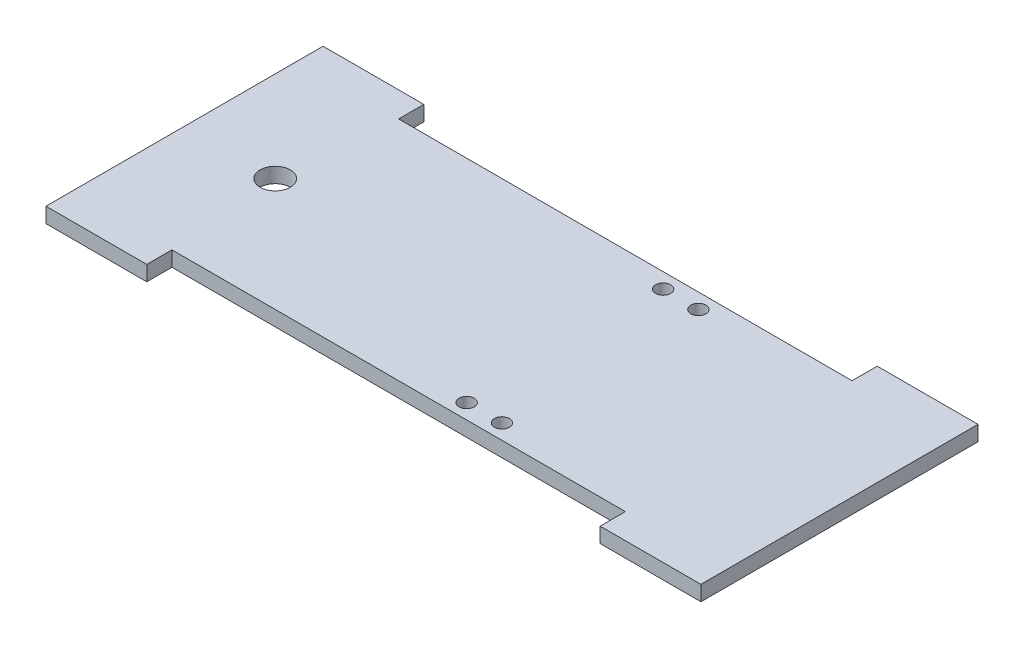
ISO-10303-21;
HEADER;
FILE_DESCRIPTION(('STEP AP214'),'2;1');
FILE_NAME('part.step','',(''),(''),'','','');
FILE_SCHEMA(('AUTOMOTIVE_DESIGN { 1 0 10303 214 1 1 1 1 }'));
ENDSEC;
DATA;
#1=APPLICATION_CONTEXT('core data for automotive mechanical design processes');
#2=APPLICATION_PROTOCOL_DEFINITION('international standard','automotive_design',2000,#1);
#3=PRODUCT_CONTEXT('',#1,'mechanical');
#4=PRODUCT('Part','Part','',(#3));
#5=PRODUCT_RELATED_PRODUCT_CATEGORY('part','',(#4));
#6=PRODUCT_DEFINITION_FORMATION('','',#4);
#7=PRODUCT_DEFINITION_CONTEXT('part definition',#1,'design');
#8=PRODUCT_DEFINITION('design','',#6,#7);
#9=PRODUCT_DEFINITION_SHAPE('','',#8);
#10=(LENGTH_UNIT() NAMED_UNIT(*) SI_UNIT(.MILLI.,.METRE.));
#11=(NAMED_UNIT(*) PLANE_ANGLE_UNIT() SI_UNIT($,.RADIAN.));
#12=(NAMED_UNIT(*) SI_UNIT($,.STERADIAN.) SOLID_ANGLE_UNIT());
#13=UNCERTAINTY_MEASURE_WITH_UNIT(LENGTH_MEASURE(1.E-05),#10,'distance_accuracy_value','');
#14=(GEOMETRIC_REPRESENTATION_CONTEXT(3) GLOBAL_UNCERTAINTY_ASSIGNED_CONTEXT((#13)) GLOBAL_UNIT_ASSIGNED_CONTEXT((#10,
#11,#12)) REPRESENTATION_CONTEXT('',''));
#15=CARTESIAN_POINT('',(0.,0.,0.));
#16=DIRECTION('',(0.,0.,1.));
#17=DIRECTION('',(1.,0.,0.));
#18=AXIS2_PLACEMENT_3D('',#15,#16,#17);
#19=CARTESIAN_POINT('',(-86.093926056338,0.420950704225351,55.));
#20=DIRECTION('',(0.,0.,1.));
#21=DIRECTION('',(1.,0.,0.));
#22=AXIS2_PLACEMENT_3D('',#19,#20,#21);
#23=PLANE('',#22);
#24=DIRECTION('',(0.,-1.,0.));
#25=VECTOR('',#24,1.);
#26=CARTESIAN_POINT('',(-66.093926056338,0.420950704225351,55.));
#27=LINE('',#26,#25);
#28=CARTESIAN_POINT('',(-66.093926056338,3.42095070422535,55.));
#29=VERTEX_POINT('',#28);
#30=CARTESIAN_POINT('',(-66.093926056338,0.420950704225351,55.));
#31=VERTEX_POINT('',#30);
#32=EDGE_CURVE('E11',#29,#31,#27,.T.);
#33=ORIENTED_EDGE('',*,*,#32,.F.);
#34=DIRECTION('',(-1.,0.,0.));
#35=VECTOR('',#34,1.);
#36=CARTESIAN_POINT('',(-86.093926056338,3.42095070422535,55.));
#37=LINE('',#36,#35);
#38=CARTESIAN_POINT('',(-86.093926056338,3.42095070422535,55.));
#39=VERTEX_POINT('',#38);
#40=EDGE_CURVE('E191',#29,#39,#37,.T.);
#41=ORIENTED_EDGE('',*,*,#40,.T.);
#42=DIRECTION('',(0.,-1.,0.));
#43=VECTOR('',#42,1.);
#44=CARTESIAN_POINT('',(-86.093926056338,3.42095070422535,55.));
#45=LINE('',#44,#43);
#46=CARTESIAN_POINT('',(-86.093926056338,0.420950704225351,55.));
#47=VERTEX_POINT('',#46);
#48=EDGE_CURVE('E182',#39,#47,#45,.T.);
#49=ORIENTED_EDGE('',*,*,#48,.T.);
#50=DIRECTION('',(1.,0.,0.));
#51=VECTOR('',#50,1.);
#52=CARTESIAN_POINT('',(-86.093926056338,0.420950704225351,55.));
#53=LINE('',#52,#51);
#54=EDGE_CURVE('E186',#47,#31,#53,.T.);
#55=ORIENTED_EDGE('',*,*,#54,.T.);
#56=EDGE_LOOP('',(#33,#41,#49,#55));
#57=FACE_BOUND('',#56,.T.);
#58=ADVANCED_FACE('F31',(#57),#23,.T.);
#59=CARTESIAN_POINT('',(-86.093926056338,0.420950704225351,0.));
#60=DIRECTION('',(0.,0.,1.));
#61=DIRECTION('',(1.,0.,0.));
#62=AXIS2_PLACEMENT_3D('',#59,#60,#61);
#63=PLANE('',#62);
#64=DIRECTION('',(-1.,0.,0.));
#65=VECTOR('',#64,1.);
#66=CARTESIAN_POINT('',(-86.093926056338,3.42095070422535,0.));
#67=LINE('',#66,#65);
#68=CARTESIAN_POINT('',(-66.093926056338,3.42095070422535,0.));
#69=VERTEX_POINT('',#68);
#70=CARTESIAN_POINT('',(-86.093926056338,3.42095070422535,0.));
#71=VERTEX_POINT('',#70);
#72=EDGE_CURVE('E178',#69,#71,#67,.T.);
#73=ORIENTED_EDGE('',*,*,#72,.F.);
#74=DIRECTION('',(0.,-1.,0.));
#75=VECTOR('',#74,1.);
#76=CARTESIAN_POINT('',(-66.093926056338,0.420950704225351,0.));
#77=LINE('',#76,#75);
#78=CARTESIAN_POINT('',(-66.093926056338,0.420950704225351,0.));
#79=VERTEX_POINT('',#78);
#80=EDGE_CURVE('E208',#69,#79,#77,.T.);
#81=ORIENTED_EDGE('',*,*,#80,.T.);
#82=DIRECTION('',(1.,0.,0.));
#83=VECTOR('',#82,1.);
#84=CARTESIAN_POINT('',(-86.093926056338,0.420950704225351,0.));
#85=LINE('',#84,#83);
#86=CARTESIAN_POINT('',(-86.093926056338,0.420950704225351,0.));
#87=VERTEX_POINT('',#86);
#88=EDGE_CURVE('E173',#87,#79,#85,.T.);
#89=ORIENTED_EDGE('',*,*,#88,.F.);
#90=DIRECTION('',(0.,-1.,0.));
#91=VECTOR('',#90,1.);
#92=CARTESIAN_POINT('',(-86.093926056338,3.42095070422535,0.));
#93=LINE('',#92,#91);
#94=EDGE_CURVE('E169',#71,#87,#93,.T.);
#95=ORIENTED_EDGE('',*,*,#94,.F.);
#96=EDGE_LOOP('',(#73,#81,#89,#95));
#97=FACE_BOUND('',#96,.T.);
#98=ADVANCED_FACE('F212',(#97),#63,.F.);
#99=CARTESIAN_POINT('',(-86.093926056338,3.42095070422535,55.));
#100=DIRECTION('',(1.,0.,0.));
#101=DIRECTION('',(0.,0.,-1.));
#102=AXIS2_PLACEMENT_3D('',#99,#100,#101);
#103=PLANE('',#102);
#104=ORIENTED_EDGE('',*,*,#94,.T.);
#105=DIRECTION('',(0.,0.,-1.));
#106=VECTOR('',#105,1.);
#107=CARTESIAN_POINT('',(-86.093926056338,0.420950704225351,55.));
#108=LINE('',#107,#106);
#109=EDGE_CURVE('E203',#47,#87,#108,.T.);
#110=ORIENTED_EDGE('',*,*,#109,.F.);
#111=ORIENTED_EDGE('',*,*,#48,.F.);
#112=DIRECTION('',(0.,0.,-1.));
#113=VECTOR('',#112,1.);
#114=CARTESIAN_POINT('',(-86.093926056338,3.42095070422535,55.));
#115=LINE('',#114,#113);
#116=EDGE_CURVE('E194',#39,#71,#115,.T.);
#117=ORIENTED_EDGE('',*,*,#116,.T.);
#118=EDGE_LOOP('',(#104,#110,#111,#117));
#119=FACE_BOUND('',#118,.T.);
#120=ADVANCED_FACE('F33',(#119),#103,.F.);
#121=CARTESIAN_POINT('',(-86.093926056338,0.420950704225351,55.));
#122=DIRECTION('',(0.,1.,0.));
#123=DIRECTION('',(0.,0.,1.));
#124=AXIS2_PLACEMENT_3D('',#121,#122,#123);
#125=PLANE('',#124);
#126=CARTESIAN_POINT('',(-10.593926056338,0.420950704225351,8.));
#127=DIRECTION('',(0.,1.,0.));
#128=DIRECTION('',(0.,0.,1.));
#129=AXIS2_PLACEMENT_3D('',#126,#127,#128);
#130=CIRCLE('',#129,1.5);
#131=CARTESIAN_POINT('',(-10.593926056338,0.420950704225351,9.5));
#132=VERTEX_POINT('',#131);
#133=EDGE_CURVE('E273',#132,#132,#130,.T.);
#134=ORIENTED_EDGE('',*,*,#133,.T.);
#135=EDGE_LOOP('',(#134));
#136=FACE_BOUND('',#135,.T.);
#137=CARTESIAN_POINT('',(-10.593926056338,0.420950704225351,47.));
#138=DIRECTION('',(0.,1.,0.));
#139=DIRECTION('',(0.,0.,1.));
#140=AXIS2_PLACEMENT_3D('',#137,#138,#139);
#141=CIRCLE('',#140,1.5);
#142=CARTESIAN_POINT('',(-10.593926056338,0.420950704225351,48.5));
#143=VERTEX_POINT('',#142);
#144=EDGE_CURVE('E267',#143,#143,#141,.T.);
#145=ORIENTED_EDGE('',*,*,#144,.T.);
#146=EDGE_LOOP('',(#145));
#147=FACE_BOUND('',#146,.T.);
#148=CARTESIAN_POINT('',(-3.59392605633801,0.420950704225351,47.));
#149=DIRECTION('',(0.,1.,0.));
#150=DIRECTION('',(0.,0.,1.));
#151=AXIS2_PLACEMENT_3D('',#148,#149,#150);
#152=CIRCLE('',#151,1.5);
#153=CARTESIAN_POINT('',(-3.59392605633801,0.420950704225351,48.5));
#154=VERTEX_POINT('',#153);
#155=EDGE_CURVE('E258',#154,#154,#152,.T.);
#156=ORIENTED_EDGE('',*,*,#155,.T.);
#157=EDGE_LOOP('',(#156));
#158=FACE_BOUND('',#157,.T.);
#159=CARTESIAN_POINT('',(-3.59392605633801,0.420950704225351,8.));
#160=DIRECTION('',(0.,1.,0.));
#161=DIRECTION('',(0.,0.,1.));
#162=AXIS2_PLACEMENT_3D('',#159,#160,#161);
#163=CIRCLE('',#162,1.5);
#164=CARTESIAN_POINT('',(-3.59392605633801,0.420950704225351,9.5));
#165=VERTEX_POINT('',#164);
#166=EDGE_CURVE('E252',#165,#165,#163,.T.);
#167=ORIENTED_EDGE('',*,*,#166,.T.);
#168=EDGE_LOOP('',(#167));
#169=FACE_BOUND('',#168,.T.);
#170=CARTESIAN_POINT('',(-68.093926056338,0.420950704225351,27.5));
#171=DIRECTION('',(0.,1.,0.));
#172=DIRECTION('',(0.,0.,1.));
#173=AXIS2_PLACEMENT_3D('',#170,#171,#172);
#174=CIRCLE('',#173,3.00000000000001);
#175=CARTESIAN_POINT('',(-68.093926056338,0.420950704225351,30.5));
#176=VERTEX_POINT('',#175);
#177=EDGE_CURVE('E245',#176,#176,#174,.T.);
#178=ORIENTED_EDGE('',*,*,#177,.T.);
#179=EDGE_LOOP('',(#178));
#180=FACE_BOUND('',#179,.T.);
#181=DIRECTION('',(-1.,0.,0.));
#182=VECTOR('',#181,1.);
#183=CARTESIAN_POINT('',(-86.093926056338,0.420950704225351,50.));
#184=LINE('',#183,#182);
#185=CARTESIAN_POINT('',(23.906073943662,0.420950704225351,50.));
#186=VERTEX_POINT('',#185);
#187=CARTESIAN_POINT('',(-66.093926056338,0.420950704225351,50.));
#188=VERTEX_POINT('',#187);
#189=EDGE_CURVE('E127',#186,#188,#184,.T.);
#190=ORIENTED_EDGE('',*,*,#189,.T.);
#191=DIRECTION('',(0.,0.,1.));
#192=VECTOR('',#191,1.);
#193=CARTESIAN_POINT('',(-66.093926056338,0.420950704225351,55.));
#194=LINE('',#193,#192);
#195=EDGE_CURVE('E145',#188,#31,#194,.T.);
#196=ORIENTED_EDGE('',*,*,#195,.T.);
#197=ORIENTED_EDGE('',*,*,#54,.F.);
#198=ORIENTED_EDGE('',*,*,#109,.T.);
#199=ORIENTED_EDGE('',*,*,#88,.T.);
#200=DIRECTION('',(0.,0.,1.));
#201=VECTOR('',#200,1.);
#202=CARTESIAN_POINT('',(-66.093926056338,0.420950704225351,55.));
#203=LINE('',#202,#201);
#204=CARTESIAN_POINT('',(-66.093926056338,0.420950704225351,5.));
#205=VERTEX_POINT('',#204);
#206=EDGE_CURVE('E163',#79,#205,#203,.T.);
#207=ORIENTED_EDGE('',*,*,#206,.T.);
#208=DIRECTION('',(1.,0.,0.));
#209=VECTOR('',#208,1.);
#210=CARTESIAN_POINT('',(-86.093926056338,0.420950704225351,5.));
#211=LINE('',#210,#209);
#212=CARTESIAN_POINT('',(23.906073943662,0.420950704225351,4.99999999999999));
#213=VERTEX_POINT('',#212);
#214=EDGE_CURVE('E166',#205,#213,#211,.T.);
#215=ORIENTED_EDGE('',*,*,#214,.T.);
#216=DIRECTION('',(0.,0.,-1.));
#217=VECTOR('',#216,1.);
#218=CARTESIAN_POINT('',(23.906073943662,0.420950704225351,55.));
#219=LINE('',#218,#217);
#220=CARTESIAN_POINT('',(23.906073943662,0.420950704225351,0.));
#221=VERTEX_POINT('',#220);
#222=EDGE_CURVE('E159',#213,#221,#219,.T.);
#223=ORIENTED_EDGE('',*,*,#222,.T.);
#224=CARTESIAN_POINT('',(43.906073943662,0.420950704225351,0.));
#225=VERTEX_POINT('',#224);
#226=EDGE_CURVE('E172',#221,#225,#85,.T.);
#227=ORIENTED_EDGE('',*,*,#226,.T.);
#228=DIRECTION('',(0.,0.,-1.));
#229=VECTOR('',#228,1.);
#230=CARTESIAN_POINT('',(43.906073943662,0.420950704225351,55.));
#231=LINE('',#230,#229);
#232=CARTESIAN_POINT('',(43.906073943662,0.420950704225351,55.));
#233=VERTEX_POINT('',#232);
#234=EDGE_CURVE('E200',#233,#225,#231,.T.);
#235=ORIENTED_EDGE('',*,*,#234,.F.);
#236=CARTESIAN_POINT('',(23.906073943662,0.420950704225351,55.));
#237=VERTEX_POINT('',#236);
#238=EDGE_CURVE('E185',#237,#233,#53,.T.);
#239=ORIENTED_EDGE('',*,*,#238,.F.);
#240=DIRECTION('',(0.,0.,-1.));
#241=VECTOR('',#240,1.);
#242=CARTESIAN_POINT('',(23.906073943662,0.420950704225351,55.));
#243=LINE('',#242,#241);
#244=EDGE_CURVE('E46',#237,#186,#243,.T.);
#245=ORIENTED_EDGE('',*,*,#244,.T.);
#246=EDGE_LOOP('',(#190,#196,#197,#198,#199,#207,#215,#223,#227,#235,#239,#245));
#247=FACE_BOUND('',#246,.T.);
#248=ADVANCED_FACE('F217',(#136,#147,#158,#169,#180,#247),#125,.F.);
#249=CARTESIAN_POINT('',(43.906073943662,3.42095070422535,55.));
#250=DIRECTION('',(-1.,0.,0.));
#251=DIRECTION('',(0.,0.,1.));
#252=AXIS2_PLACEMENT_3D('',#249,#250,#251);
#253=PLANE('',#252);
#254=DIRECTION('',(0.,1.,0.));
#255=VECTOR('',#254,1.);
#256=CARTESIAN_POINT('',(43.906073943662,3.42095070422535,0.));
#257=LINE('',#256,#255);
#258=CARTESIAN_POINT('',(43.906073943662,3.42095070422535,0.));
#259=VERTEX_POINT('',#258);
#260=EDGE_CURVE('E176',#225,#259,#257,.T.);
#261=ORIENTED_EDGE('',*,*,#260,.T.);
#262=DIRECTION('',(0.,0.,-1.));
#263=VECTOR('',#262,1.);
#264=CARTESIAN_POINT('',(43.906073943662,3.42095070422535,55.));
#265=LINE('',#264,#263);
#266=CARTESIAN_POINT('',(43.906073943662,3.42095070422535,55.));
#267=VERTEX_POINT('',#266);
#268=EDGE_CURVE('E197',#267,#259,#265,.T.);
#269=ORIENTED_EDGE('',*,*,#268,.F.);
#270=DIRECTION('',(0.,1.,0.));
#271=VECTOR('',#270,1.);
#272=CARTESIAN_POINT('',(43.906073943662,3.42095070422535,55.));
#273=LINE('',#272,#271);
#274=EDGE_CURVE('E189',#233,#267,#273,.T.);
#275=ORIENTED_EDGE('',*,*,#274,.F.);
#276=ORIENTED_EDGE('',*,*,#234,.T.);
#277=EDGE_LOOP('',(#261,#269,#275,#276));
#278=FACE_BOUND('',#277,.T.);
#279=ADVANCED_FACE('F236',(#278),#253,.F.);
#280=CARTESIAN_POINT('',(-86.093926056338,3.42095070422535,55.));
#281=DIRECTION('',(0.,-1.,0.));
#282=DIRECTION('',(0.,0.,-1.));
#283=AXIS2_PLACEMENT_3D('',#280,#281,#282);
#284=PLANE('',#283);
#285=CARTESIAN_POINT('',(-10.593926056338,3.42095070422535,8.));
#286=DIRECTION('',(0.,1.,0.));
#287=DIRECTION('',(0.,0.,1.));
#288=AXIS2_PLACEMENT_3D('',#285,#286,#287);
#289=CIRCLE('',#288,1.5);
#290=CARTESIAN_POINT('',(-10.593926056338,3.42095070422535,9.5));
#291=VERTEX_POINT('',#290);
#292=EDGE_CURVE('E270',#291,#291,#289,.T.);
#293=ORIENTED_EDGE('',*,*,#292,.F.);
#294=EDGE_LOOP('',(#293));
#295=FACE_BOUND('',#294,.T.);
#296=CARTESIAN_POINT('',(-10.593926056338,3.42095070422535,47.));
#297=DIRECTION('',(0.,1.,0.));
#298=DIRECTION('',(0.,0.,1.));
#299=AXIS2_PLACEMENT_3D('',#296,#297,#298);
#300=CIRCLE('',#299,1.5);
#301=CARTESIAN_POINT('',(-10.593926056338,3.42095070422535,48.5));
#302=VERTEX_POINT('',#301);
#303=EDGE_CURVE('E264',#302,#302,#300,.T.);
#304=ORIENTED_EDGE('',*,*,#303,.F.);
#305=EDGE_LOOP('',(#304));
#306=FACE_BOUND('',#305,.T.);
#307=CARTESIAN_POINT('',(-3.59392605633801,3.42095070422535,47.));
#308=DIRECTION('',(0.,1.,0.));
#309=DIRECTION('',(0.,0.,1.));
#310=AXIS2_PLACEMENT_3D('',#307,#308,#309);
#311=CIRCLE('',#310,1.5);
#312=CARTESIAN_POINT('',(-3.59392605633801,3.42095070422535,48.5));
#313=VERTEX_POINT('',#312);
#314=EDGE_CURVE('E261',#313,#313,#311,.T.);
#315=ORIENTED_EDGE('',*,*,#314,.F.);
#316=EDGE_LOOP('',(#315));
#317=FACE_BOUND('',#316,.T.);
#318=CARTESIAN_POINT('',(-3.59392605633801,3.42095070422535,8.));
#319=DIRECTION('',(0.,1.,0.));
#320=DIRECTION('',(0.,0.,1.));
#321=AXIS2_PLACEMENT_3D('',#318,#319,#320);
#322=CIRCLE('',#321,1.5);
#323=CARTESIAN_POINT('',(-3.59392605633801,3.42095070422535,9.5));
#324=VERTEX_POINT('',#323);
#325=EDGE_CURVE('E255',#324,#324,#322,.T.);
#326=ORIENTED_EDGE('',*,*,#325,.F.);
#327=EDGE_LOOP('',(#326));
#328=FACE_BOUND('',#327,.T.);
#329=CARTESIAN_POINT('',(-68.093926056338,3.42095070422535,27.5));
#330=DIRECTION('',(0.,1.,0.));
#331=DIRECTION('',(0.,0.,1.));
#332=AXIS2_PLACEMENT_3D('',#329,#330,#331);
#333=CIRCLE('',#332,3.00000000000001);
#334=CARTESIAN_POINT('',(-68.093926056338,3.42095070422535,30.5));
#335=VERTEX_POINT('',#334);
#336=EDGE_CURVE('E247',#335,#335,#333,.T.);
#337=ORIENTED_EDGE('',*,*,#336,.F.);
#338=EDGE_LOOP('',(#337));
#339=FACE_BOUND('',#338,.T.);
#340=ORIENTED_EDGE('',*,*,#40,.F.);
#341=DIRECTION('',(0.,0.,1.));
#342=VECTOR('',#341,1.);
#343=CARTESIAN_POINT('',(-66.093926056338,3.42095070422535,50.));
#344=LINE('',#343,#342);
#345=CARTESIAN_POINT('',(-66.093926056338,3.42095070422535,50.));
#346=VERTEX_POINT('',#345);
#347=EDGE_CURVE('E136',#346,#29,#344,.T.);
#348=ORIENTED_EDGE('',*,*,#347,.F.);
#349=DIRECTION('',(-1.,0.,0.));
#350=VECTOR('',#349,1.);
#351=CARTESIAN_POINT('',(-66.093926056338,3.42095070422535,50.));
#352=LINE('',#351,#350);
#353=CARTESIAN_POINT('',(23.906073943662,3.42095070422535,50.));
#354=VERTEX_POINT('',#353);
#355=EDGE_CURVE('E124',#354,#346,#352,.T.);
#356=ORIENTED_EDGE('',*,*,#355,.F.);
#357=DIRECTION('',(0.,0.,-1.));
#358=VECTOR('',#357,1.);
#359=CARTESIAN_POINT('',(23.906073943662,3.42095070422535,50.));
#360=LINE('',#359,#358);
#361=CARTESIAN_POINT('',(23.906073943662,3.42095070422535,55.));
#362=VERTEX_POINT('',#361);
#363=EDGE_CURVE('E131',#362,#354,#360,.T.);
#364=ORIENTED_EDGE('',*,*,#363,.F.);
#365=EDGE_CURVE('E192',#267,#362,#37,.T.);
#366=ORIENTED_EDGE('',*,*,#365,.F.);
#367=ORIENTED_EDGE('',*,*,#268,.T.);
#368=CARTESIAN_POINT('',(23.906073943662,3.42095070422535,0.));
#369=VERTEX_POINT('',#368);
#370=EDGE_CURVE('E179',#259,#369,#67,.T.);
#371=ORIENTED_EDGE('',*,*,#370,.T.);
#372=DIRECTION('',(0.,0.,-1.));
#373=VECTOR('',#372,1.);
#374=CARTESIAN_POINT('',(23.906073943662,3.42095070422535,-6.15734812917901));
#375=LINE('',#374,#373);
#376=CARTESIAN_POINT('',(23.906073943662,3.42095070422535,4.99999999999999));
#377=VERTEX_POINT('',#376);
#378=EDGE_CURVE('E54',#377,#369,#375,.T.);
#379=ORIENTED_EDGE('',*,*,#378,.F.);
#380=DIRECTION('',(1.,0.,0.));
#381=VECTOR('',#380,1.);
#382=CARTESIAN_POINT('',(-66.093926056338,3.42095070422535,5.));
#383=LINE('',#382,#381);
#384=CARTESIAN_POINT('',(-66.093926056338,3.42095070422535,5.));
#385=VERTEX_POINT('',#384);
#386=EDGE_CURVE('E152',#385,#377,#383,.T.);
#387=ORIENTED_EDGE('',*,*,#386,.F.);
#388=DIRECTION('',(0.,0.,1.));
#389=VECTOR('',#388,1.);
#390=CARTESIAN_POINT('',(-66.093926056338,3.42095070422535,-6.157348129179));
#391=LINE('',#390,#389);
#392=EDGE_CURVE('E149',#69,#385,#391,.T.);
#393=ORIENTED_EDGE('',*,*,#392,.F.);
#394=ORIENTED_EDGE('',*,*,#72,.T.);
#395=ORIENTED_EDGE('',*,*,#116,.F.);
#396=EDGE_LOOP('',(#340,#348,#356,#364,#366,#367,#371,#379,#387,#393,#394,#395));
#397=FACE_BOUND('',#396,.T.);
#398=ADVANCED_FACE('F139',(#295,#306,#317,#328,#339,#397),#284,.F.);
#399=DIRECTION('',(0.,1.,0.));
#400=VECTOR('',#399,1.);
#401=CARTESIAN_POINT('',(23.906073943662,0.420950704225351,55.));
#402=LINE('',#401,#400);
#403=EDGE_CURVE('E39',#237,#362,#402,.T.);
#404=ORIENTED_EDGE('',*,*,#403,.F.);
#405=ORIENTED_EDGE('',*,*,#238,.T.);
#406=ORIENTED_EDGE('',*,*,#274,.T.);
#407=ORIENTED_EDGE('',*,*,#365,.T.);
#408=EDGE_LOOP('',(#404,#405,#406,#407));
#409=FACE_BOUND('',#408,.T.);
#410=ADVANCED_FACE('F239',(#409),#23,.T.);
#411=ORIENTED_EDGE('',*,*,#226,.F.);
#412=DIRECTION('',(0.,1.,0.));
#413=VECTOR('',#412,1.);
#414=CARTESIAN_POINT('',(23.906073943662,0.420950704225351,0.));
#415=LINE('',#414,#413);
#416=EDGE_CURVE('E206',#221,#369,#415,.T.);
#417=ORIENTED_EDGE('',*,*,#416,.T.);
#418=ORIENTED_EDGE('',*,*,#370,.F.);
#419=ORIENTED_EDGE('',*,*,#260,.F.);
#420=EDGE_LOOP('',(#411,#417,#418,#419));
#421=FACE_BOUND('',#420,.T.);
#422=ADVANCED_FACE('F232',(#421),#63,.F.);
#423=CARTESIAN_POINT('',(-66.093926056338,-6.57904929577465,5.));
#424=DIRECTION('',(0.,0.,1.));
#425=DIRECTION('',(1.,0.,0.));
#426=AXIS2_PLACEMENT_3D('',#423,#424,#425);
#427=PLANE('',#426);
#428=DIRECTION('',(0.,1.,0.));
#429=VECTOR('',#428,1.);
#430=CARTESIAN_POINT('',(-66.093926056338,-6.57904929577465,5.));
#431=LINE('',#430,#429);
#432=EDGE_CURVE('E156',#205,#385,#431,.T.);
#433=ORIENTED_EDGE('',*,*,#432,.T.);
#434=ORIENTED_EDGE('',*,*,#386,.T.);
#435=DIRECTION('',(0.,1.,0.));
#436=VECTOR('',#435,1.);
#437=CARTESIAN_POINT('',(23.906073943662,-6.57904929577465,4.99999999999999));
#438=LINE('',#437,#436);
#439=EDGE_CURVE('E157',#213,#377,#438,.T.);
#440=ORIENTED_EDGE('',*,*,#439,.F.);
#441=ORIENTED_EDGE('',*,*,#214,.F.);
#442=EDGE_LOOP('',(#433,#434,#440,#441));
#443=FACE_BOUND('',#442,.T.);
#444=ADVANCED_FACE('F226',(#443),#427,.F.);
#445=CARTESIAN_POINT('',(-66.093926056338,-6.57904929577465,-6.157348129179));
#446=DIRECTION('',(-1.,0.,0.));
#447=DIRECTION('',(0.,0.,1.));
#448=AXIS2_PLACEMENT_3D('',#445,#446,#447);
#449=PLANE('',#448);
#450=ORIENTED_EDGE('',*,*,#80,.F.);
#451=ORIENTED_EDGE('',*,*,#392,.T.);
#452=ORIENTED_EDGE('',*,*,#432,.F.);
#453=ORIENTED_EDGE('',*,*,#206,.F.);
#454=EDGE_LOOP('',(#450,#451,#452,#453));
#455=FACE_BOUND('',#454,.T.);
#456=ADVANCED_FACE('F224',(#455),#449,.F.);
#457=CARTESIAN_POINT('',(23.906073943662,-6.57904929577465,-6.15734812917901));
#458=DIRECTION('',(1.,0.,0.));
#459=DIRECTION('',(0.,0.,-1.));
#460=AXIS2_PLACEMENT_3D('',#457,#458,#459);
#461=PLANE('',#460);
#462=ORIENTED_EDGE('',*,*,#439,.T.);
#463=ORIENTED_EDGE('',*,*,#378,.T.);
#464=ORIENTED_EDGE('',*,*,#416,.F.);
#465=ORIENTED_EDGE('',*,*,#222,.F.);
#466=EDGE_LOOP('',(#462,#463,#464,#465));
#467=FACE_BOUND('',#466,.T.);
#468=ADVANCED_FACE('F329',(#467),#461,.F.);
#469=CARTESIAN_POINT('',(-66.093926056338,-6.57904929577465,50.));
#470=DIRECTION('',(0.,0.,-1.));
#471=DIRECTION('',(-1.,0.,0.));
#472=AXIS2_PLACEMENT_3D('',#469,#470,#471);
#473=PLANE('',#472);
#474=DIRECTION('',(0.,1.,0.));
#475=VECTOR('',#474,1.);
#476=CARTESIAN_POINT('',(23.906073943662,-6.57904929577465,50.));
#477=LINE('',#476,#475);
#478=EDGE_CURVE('E119',#186,#354,#477,.T.);
#479=ORIENTED_EDGE('',*,*,#478,.T.);
#480=ORIENTED_EDGE('',*,*,#355,.T.);
#481=DIRECTION('',(0.,1.,0.));
#482=VECTOR('',#481,1.);
#483=CARTESIAN_POINT('',(-66.093926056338,-6.57904929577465,50.));
#484=LINE('',#483,#482);
#485=EDGE_CURVE('E128',#188,#346,#484,.T.);
#486=ORIENTED_EDGE('',*,*,#485,.F.);
#487=ORIENTED_EDGE('',*,*,#189,.F.);
#488=EDGE_LOOP('',(#479,#480,#486,#487));
#489=FACE_BOUND('',#488,.T.);
#490=ADVANCED_FACE('F121',(#489),#473,.F.);
#491=CARTESIAN_POINT('',(-66.093926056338,-6.57904929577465,50.));
#492=DIRECTION('',(-1.,0.,0.));
#493=DIRECTION('',(0.,0.,1.));
#494=AXIS2_PLACEMENT_3D('',#491,#492,#493);
#495=PLANE('',#494);
#496=ORIENTED_EDGE('',*,*,#485,.T.);
#497=ORIENTED_EDGE('',*,*,#347,.T.);
#498=ORIENTED_EDGE('',*,*,#32,.T.);
#499=ORIENTED_EDGE('',*,*,#195,.F.);
#500=EDGE_LOOP('',(#496,#497,#498,#499));
#501=FACE_BOUND('',#500,.T.);
#502=ADVANCED_FACE('F244',(#501),#495,.F.);
#503=CARTESIAN_POINT('',(23.906073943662,-6.57904929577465,50.));
#504=DIRECTION('',(1.,0.,0.));
#505=DIRECTION('',(0.,0.,-1.));
#506=AXIS2_PLACEMENT_3D('',#503,#504,#505);
#507=PLANE('',#506);
#508=ORIENTED_EDGE('',*,*,#403,.T.);
#509=ORIENTED_EDGE('',*,*,#363,.T.);
#510=ORIENTED_EDGE('',*,*,#478,.F.);
#511=ORIENTED_EDGE('',*,*,#244,.F.);
#512=EDGE_LOOP('',(#508,#509,#510,#511));
#513=FACE_BOUND('',#512,.T.);
#514=ADVANCED_FACE('F132',(#513),#507,.F.);
#515=CARTESIAN_POINT('',(-68.093926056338,0.420950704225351,27.5));
#516=DIRECTION('',(0.,1.,0.));
#517=DIRECTION('',(0.,0.,1.));
#518=AXIS2_PLACEMENT_3D('',#515,#516,#517);
#519=CYLINDRICAL_SURFACE('',#518,3.00000000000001);
#520=ORIENTED_EDGE('',*,*,#177,.F.);
#521=EDGE_LOOP('',(#520));
#522=FACE_BOUND('',#521,.T.);
#523=ORIENTED_EDGE('',*,*,#336,.T.);
#524=EDGE_LOOP('',(#523));
#525=FACE_BOUND('',#524,.T.);
#526=ADVANCED_FACE('F297',(#522,#525),#519,.F.);
#527=CARTESIAN_POINT('',(-3.59392605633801,0.420950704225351,8.));
#528=DIRECTION('',(0.,1.,0.));
#529=DIRECTION('',(0.,0.,1.));
#530=AXIS2_PLACEMENT_3D('',#527,#528,#529);
#531=CYLINDRICAL_SURFACE('',#530,1.5);
#532=ORIENTED_EDGE('',*,*,#166,.F.);
#533=EDGE_LOOP('',(#532));
#534=FACE_BOUND('',#533,.T.);
#535=ORIENTED_EDGE('',*,*,#325,.T.);
#536=EDGE_LOOP('',(#535));
#537=FACE_BOUND('',#536,.T.);
#538=ADVANCED_FACE('F299',(#534,#537),#531,.F.);
#539=CARTESIAN_POINT('',(-3.59392605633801,0.420950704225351,47.));
#540=DIRECTION('',(0.,1.,0.));
#541=DIRECTION('',(0.,0.,1.));
#542=AXIS2_PLACEMENT_3D('',#539,#540,#541);
#543=CYLINDRICAL_SURFACE('',#542,1.5);
#544=ORIENTED_EDGE('',*,*,#155,.F.);
#545=EDGE_LOOP('',(#544));
#546=FACE_BOUND('',#545,.T.);
#547=ORIENTED_EDGE('',*,*,#314,.T.);
#548=EDGE_LOOP('',(#547));
#549=FACE_BOUND('',#548,.T.);
#550=ADVANCED_FACE('F306',(#546,#549),#543,.F.);
#551=CARTESIAN_POINT('',(-10.593926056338,0.420950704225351,47.));
#552=DIRECTION('',(0.,1.,0.));
#553=DIRECTION('',(0.,0.,1.));
#554=AXIS2_PLACEMENT_3D('',#551,#552,#553);
#555=CYLINDRICAL_SURFACE('',#554,1.5);
#556=ORIENTED_EDGE('',*,*,#144,.F.);
#557=EDGE_LOOP('',(#556));
#558=FACE_BOUND('',#557,.T.);
#559=ORIENTED_EDGE('',*,*,#303,.T.);
#560=EDGE_LOOP('',(#559));
#561=FACE_BOUND('',#560,.T.);
#562=ADVANCED_FACE('F282',(#558,#561),#555,.F.);
#563=CARTESIAN_POINT('',(-10.593926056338,0.420950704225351,8.));
#564=DIRECTION('',(0.,1.,0.));
#565=DIRECTION('',(0.,0.,1.));
#566=AXIS2_PLACEMENT_3D('',#563,#564,#565);
#567=CYLINDRICAL_SURFACE('',#566,1.5);
#568=ORIENTED_EDGE('',*,*,#133,.F.);
#569=EDGE_LOOP('',(#568));
#570=FACE_BOUND('',#569,.T.);
#571=ORIENTED_EDGE('',*,*,#292,.T.);
#572=EDGE_LOOP('',(#571));
#573=FACE_BOUND('',#572,.T.);
#574=ADVANCED_FACE('F279',(#570,#573),#567,.F.);
#575=CLOSED_SHELL('',(#58,#98,#120,#248,#279,#398,#410,#422,#444,#456,#468,#490,#502,#514,#526,
#538,#550,#562,#574));
#576=MANIFOLD_SOLID_BREP('B2',#575);
#577=ADVANCED_BREP_SHAPE_REPRESENTATION('',(#18,#576),#14);
#578=SHAPE_DEFINITION_REPRESENTATION(#9,#577);
ENDSEC;
END-ISO-10303-21;
